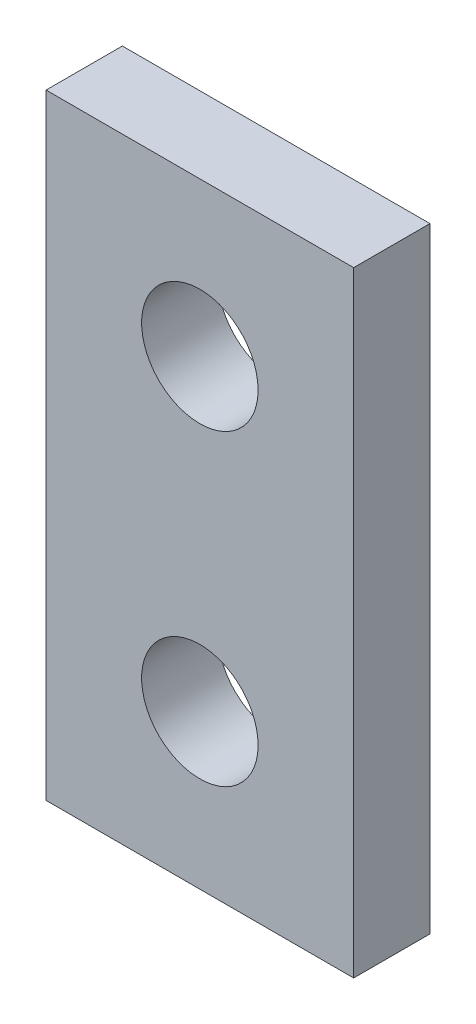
from build123d import *

# Parameters (mm, degrees)
SKETCH1_W           = 9.525
SKETCH1_H           = 19.05
BOSS_EXTRUDE1_DEPTH = 2.3622
SKETCH2_R           = 1.8034
CUT_EXTRUDE1_DEPTH  = 11.908117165


with BuildPart() as part:
    # Sketch1 → Boss-Extrude1 (new body)
    with BuildSketch(Plane.XY):
        Rectangle(SKETCH1_W, SKETCH1_H)
    extrude(amount=-BOSS_EXTRUDE1_DEPTH)

    # Sketch2 → Cut-Extrude1 (cut, through all)
    with BuildSketch(Plane.XY):
        with Locations((0, 4.7625)):
            Circle(SKETCH2_R)
        with Locations((0, -4.7625)):
            Circle(SKETCH2_R)
    extrude(amount=-CUT_EXTRUDE1_DEPTH, mode=Mode.SUBTRACT)


solid = part.part
